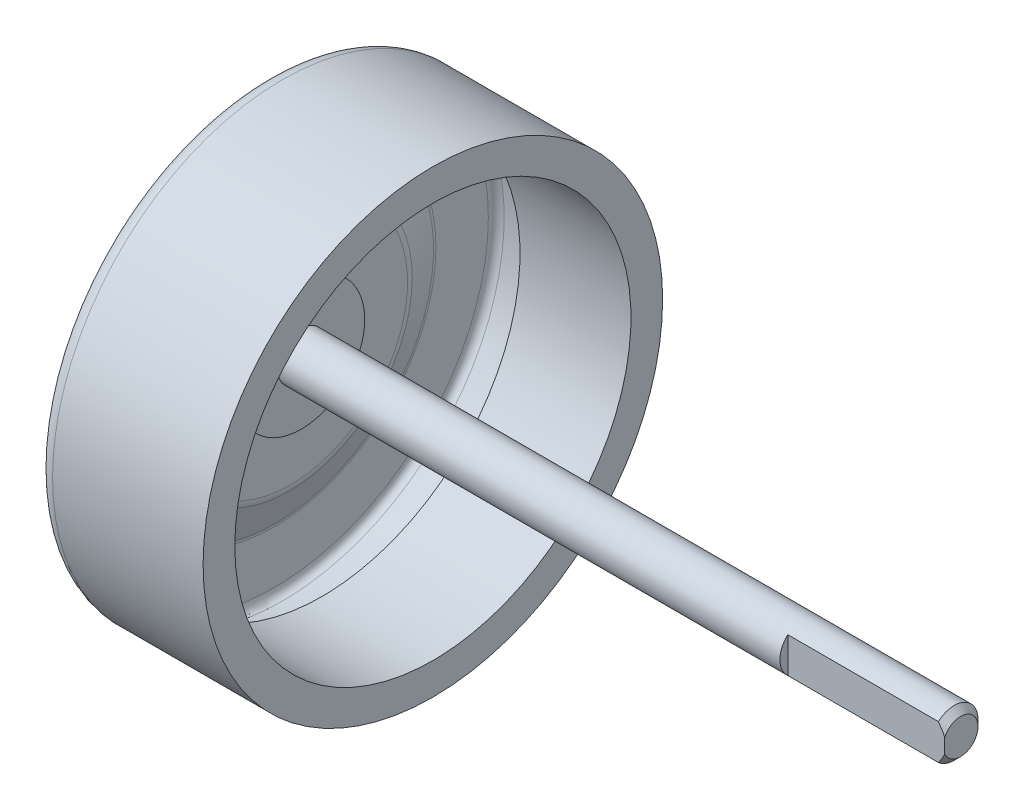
ISO-10303-21;
HEADER;
FILE_DESCRIPTION(('STEP AP214'),'2;1');
FILE_NAME('part.step','',(''),(''),'','','');
FILE_SCHEMA(('AUTOMOTIVE_DESIGN { 1 0 10303 214 1 1 1 1 }'));
ENDSEC;
DATA;
#1=APPLICATION_CONTEXT('core data for automotive mechanical design processes');
#2=APPLICATION_PROTOCOL_DEFINITION('international standard','automotive_design',2000,#1);
#3=PRODUCT_CONTEXT('',#1,'mechanical');
#4=PRODUCT('Part','Part','',(#3));
#5=PRODUCT_RELATED_PRODUCT_CATEGORY('part','',(#4));
#6=PRODUCT_DEFINITION_FORMATION('','',#4);
#7=PRODUCT_DEFINITION_CONTEXT('part definition',#1,'design');
#8=PRODUCT_DEFINITION('design','',#6,#7);
#9=PRODUCT_DEFINITION_SHAPE('','',#8);
#10=(LENGTH_UNIT() NAMED_UNIT(*) SI_UNIT(.MILLI.,.METRE.));
#11=(NAMED_UNIT(*) PLANE_ANGLE_UNIT() SI_UNIT($,.RADIAN.));
#12=(NAMED_UNIT(*) SI_UNIT($,.STERADIAN.) SOLID_ANGLE_UNIT());
#13=UNCERTAINTY_MEASURE_WITH_UNIT(LENGTH_MEASURE(1.E-05),#10,'distance_accuracy_value','');
#14=(GEOMETRIC_REPRESENTATION_CONTEXT(3) GLOBAL_UNCERTAINTY_ASSIGNED_CONTEXT((#13)) GLOBAL_UNIT_ASSIGNED_CONTEXT((#10,
#11,#12)) REPRESENTATION_CONTEXT('',''));
#15=CARTESIAN_POINT('',(0.,0.,0.));
#16=DIRECTION('',(0.,0.,1.));
#17=DIRECTION('',(1.,0.,0.));
#18=AXIS2_PLACEMENT_3D('',#15,#16,#17);
#19=CARTESIAN_POINT('',(43.8,1.5,0.));
#20=DIRECTION('',(-1.,0.,0.));
#21=DIRECTION('',(0.,0.,1.));
#22=AXIS2_PLACEMENT_3D('',#19,#20,#21);
#23=PLANE('',#22);
#24=DIRECTION('',(0.,1.,0.));
#25=VECTOR('',#24,1.);
#26=CARTESIAN_POINT('',(43.8,1.5,1.));
#27=LINE('',#26,#25);
#28=CARTESIAN_POINT('',(43.8000000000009,-0.458257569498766,1.));
#29=VERTEX_POINT('',#28);
#30=CARTESIAN_POINT('',(43.8,0.458257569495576,1.));
#31=VERTEX_POINT('',#30);
#32=EDGE_CURVE('E74',#29,#31,#27,.T.);
#33=ORIENTED_EDGE('',*,*,#32,.F.);
#34=CARTESIAN_POINT('',(43.8,0.,0.));
#35=DIRECTION('',(-1.,0.,0.));
#36=DIRECTION('',(0.,0.,1.));
#37=AXIS2_PLACEMENT_3D('',#34,#35,#36);
#38=CIRCLE('',#37,1.1);
#39=EDGE_CURVE('E145',#29,#31,#38,.F.);
#40=ORIENTED_EDGE('',*,*,#39,.T.);
#41=EDGE_LOOP('',(#33,#40));
#42=FACE_BOUND('',#41,.T.);
#43=ADVANCED_FACE('F33',(#42),#23,.F.);
#44=CARTESIAN_POINT('',(-6.43572750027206,0.,0.));
#45=DIRECTION('',(-1.,0.,0.));
#46=DIRECTION('',(0.,0.,1.));
#47=AXIS2_PLACEMENT_3D('',#44,#45,#46);
#48=CYLINDRICAL_SURFACE('',#47,1.5);
#49=CARTESIAN_POINT('',(2.2,0.,0.));
#50=DIRECTION('',(-1.,0.,0.));
#51=DIRECTION('',(0.,0.,1.));
#52=AXIS2_PLACEMENT_3D('',#49,#50,#51);
#53=CIRCLE('',#52,1.5);
#54=CARTESIAN_POINT('',(2.2,0.,1.5));
#55=VERTEX_POINT('',#54);
#56=EDGE_CURVE('E113',#55,#55,#53,.T.);
#57=ORIENTED_EDGE('',*,*,#56,.F.);
#58=EDGE_LOOP('',(#57));
#59=FACE_BOUND('',#58,.T.);
#60=CARTESIAN_POINT('',(33.9,0.,0.));
#61=DIRECTION('',(-1.,0.,0.));
#62=DIRECTION('',(0.,0.,1.));
#63=AXIS2_PLACEMENT_3D('',#60,#61,#62);
#64=CIRCLE('',#63,1.5);
#65=CARTESIAN_POINT('',(33.9,-1.11803398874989,1.));
#66=VERTEX_POINT('',#65);
#67=CARTESIAN_POINT('',(33.9,1.11803398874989,1.));
#68=VERTEX_POINT('',#67);
#69=EDGE_CURVE('E11',#66,#68,#64,.T.);
#70=ORIENTED_EDGE('',*,*,#69,.T.);
#71=DIRECTION('',(-1.,0.,0.));
#72=VECTOR('',#71,1.);
#73=CARTESIAN_POINT('',(-6.43572750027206,1.11803398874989,1.));
#74=LINE('',#73,#72);
#75=CARTESIAN_POINT('',(43.4,1.11803398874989,1.));
#76=VERTEX_POINT('',#75);
#77=EDGE_CURVE('E67',#76,#68,#74,.T.);
#78=ORIENTED_EDGE('',*,*,#77,.F.);
#79=CARTESIAN_POINT('',(43.4,0.,0.));
#80=DIRECTION('',(-1.,0.,0.));
#81=DIRECTION('',(0.,0.,1.));
#82=AXIS2_PLACEMENT_3D('',#79,#80,#81);
#83=CIRCLE('',#82,1.5);
#84=CARTESIAN_POINT('',(43.4,-1.11803398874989,1.));
#85=VERTEX_POINT('',#84);
#86=EDGE_CURVE('E143',#76,#85,#83,.T.);
#87=ORIENTED_EDGE('',*,*,#86,.T.);
#88=DIRECTION('',(-1.,0.,0.));
#89=VECTOR('',#88,1.);
#90=CARTESIAN_POINT('',(-6.43572750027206,-1.11803398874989,1.));
#91=LINE('',#90,#89);
#92=EDGE_CURVE('E48',#66,#85,#91,.F.);
#93=ORIENTED_EDGE('',*,*,#92,.F.);
#94=EDGE_LOOP('',(#70,#78,#87,#93));
#95=FACE_BOUND('',#94,.T.);
#96=ADVANCED_FACE('F65',(#59,#95),#48,.T.);
#97=CARTESIAN_POINT('',(43.4,0.,0.));
#98=DIRECTION('',(-1.,0.,0.));
#99=DIRECTION('',(0.,0.,1.));
#100=AXIS2_PLACEMENT_3D('',#97,#98,#99);
#101=CONICAL_SURFACE('',#100,1.5,0.785398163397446);
#102=ORIENTED_EDGE('',*,*,#86,.F.);
#103=CARTESIAN_POINT('',(41.5838704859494,3.16175820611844,1.));
#104=CARTESIAN_POINT('',(41.6907326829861,3.04963731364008,1.));
#105=CARTESIAN_POINT('',(41.7973646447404,2.93729302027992,1.));
#106=CARTESIAN_POINT('',(42.009902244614,2.7118529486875,1.));
#107=CARTESIAN_POINT('',(42.1158076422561,2.59875694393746,1.));
#108=CARTESIAN_POINT('',(42.3275807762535,2.37047715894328,1.));
#109=CARTESIAN_POINT('',(42.4334381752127,2.25528376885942,1.));
#110=CARTESIAN_POINT('',(42.6434934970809,2.02342800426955,1.));
#111=CARTESIAN_POINT('',(42.7476917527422,1.90676593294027,1.));
#112=CARTESIAN_POINT('',(42.9192876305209,1.71017138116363,1.));
#113=CARTESIAN_POINT('',(42.9874286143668,1.63089017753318,1.));
#114=CARTESIAN_POINT('',(43.1219727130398,1.47080590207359,1.));
#115=CARTESIAN_POINT('',(43.1883751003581,1.39000221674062,1.));
#116=CARTESIAN_POINT('',(43.3183508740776,1.22641779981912,1.));
#117=CARTESIAN_POINT('',(43.3819303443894,1.1436419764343,1.));
#118=CARTESIAN_POINT('',(43.4739505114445,1.01707595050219,1.));
#119=CARTESIAN_POINT('',(43.5040562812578,0.974501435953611,1.));
#120=CARTESIAN_POINT('',(43.5627796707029,0.888342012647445,1.));
#121=CARTESIAN_POINT('',(43.5913974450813,0.8447572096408,1.));
#122=CARTESIAN_POINT('',(43.6618365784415,0.732073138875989,1.));
#123=CARTESIAN_POINT('',(43.7022855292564,0.662097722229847,1.));
#124=CARTESIAN_POINT('',(43.7754550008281,0.518109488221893,1.));
#125=CARTESIAN_POINT('',(43.8081831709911,0.444100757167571,1.));
#126=CARTESIAN_POINT('',(43.8546882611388,0.309300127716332,1.));
#127=CARTESIAN_POINT('',(43.871105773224,0.249456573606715,1.));
#128=CARTESIAN_POINT('',(43.8935920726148,0.127975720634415,1.));
#129=CARTESIAN_POINT('',(43.8997011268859,0.06634636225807,1.));
#130=CARTESIAN_POINT('',(43.9002779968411,-0.057206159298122,1.));
#131=CARTESIAN_POINT('',(43.8947012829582,-0.119129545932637,1.));
#132=CARTESIAN_POINT('',(43.8730932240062,-0.241230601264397,1.));
#133=CARTESIAN_POINT('',(43.8570244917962,-0.301401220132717,1.));
#134=CARTESIAN_POINT('',(43.8157454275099,-0.423254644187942,1.));
#135=CARTESIAN_POINT('',(43.7899596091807,-0.48473378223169,1.));
#136=CARTESIAN_POINT('',(43.7324715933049,-0.604908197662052,1.));
#137=CARTESIAN_POINT('',(43.7007581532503,-0.663597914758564,1.));
#138=CARTESIAN_POINT('',(43.632966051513,-0.779494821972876,1.));
#139=CARTESIAN_POINT('',(43.5968311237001,-0.836668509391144,1.));
#140=CARTESIAN_POINT('',(43.5219076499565,-0.94915392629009,1.));
#141=CARTESIAN_POINT('',(43.4831214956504,-1.00446726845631,1.));
#142=CARTESIAN_POINT('',(43.4072707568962,-1.10878362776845,1.));
#143=CARTESIAN_POINT('',(43.3703676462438,-1.15790497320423,1.));
#144=CARTESIAN_POINT('',(43.2954067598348,-1.25526101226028,1.));
#145=CARTESIAN_POINT('',(43.2573488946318,-1.30349563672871,1.));
#146=CARTESIAN_POINT('',(43.141854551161,-1.44718735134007,1.));
#147=CARTESIAN_POINT('',(43.0631214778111,-1.54159990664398,1.));
#148=CARTESIAN_POINT('',(42.9034112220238,-1.72879325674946,1.));
#149=CARTESIAN_POINT('',(42.8224301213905,-1.82157067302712,1.));
#150=CARTESIAN_POINT('',(42.6590879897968,-2.0058678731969,1.));
#151=CARTESIAN_POINT('',(42.5767272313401,-2.0973878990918,1.));
#152=CARTESIAN_POINT('',(42.4190362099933,-2.27075857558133,1.));
#153=CARTESIAN_POINT('',(42.3437945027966,-2.35269003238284,1.));
#154=CARTESIAN_POINT('',(42.192719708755,-2.51601437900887,1.));
#155=CARTESIAN_POINT('',(42.1168865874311,-2.59740723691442,1.));
#156=CARTESIAN_POINT('',(41.9650490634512,-2.75948177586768,1.));
#157=CARTESIAN_POINT('',(41.8890462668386,-2.84016496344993,1.));
#158=CARTESIAN_POINT('',(41.7366956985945,-3.00119295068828,1.));
#159=CARTESIAN_POINT('',(41.6603479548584,-3.08153777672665,1.));
#160=CARTESIAN_POINT('',(41.5838704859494,-3.16175820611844,1.));
#161=B_SPLINE_CURVE_WITH_KNOTS('',3,(#103,#104,#105,#106,#107,#108,#109,#110,#111,#112,#113,
#114,#115,#116,#117,#118,#119,#120,#121,#122,#123,#124,#125,#126,#127,#128,#129,#130,#131,#132,
#133,#134,#135,#136,#137,#138,#139,#140,#141,#142,#143,#144,#145,#146,#147,#148,#149,#150,#151,
#152,#153,#154,#155,#156,#157,#158,#159,#160),.UNSPECIFIED.,.F.,.F.,(4,2,2,2,2,2,2,2,2,2,2,2,2,
2,2,2,2,2,2,2,2,2,2,2,2,2,2,2,4),(0.,0.464671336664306,0.929489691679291,1.39881843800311,
1.86805184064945,2.18165494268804,2.49538723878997,2.8084068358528,2.96481274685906,
3.12120235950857,3.36341337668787,3.60538340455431,3.79086077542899,3.975611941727,
4.16106839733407,4.34718933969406,4.54672711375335,4.74664724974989,4.94944525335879,
5.15206267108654,5.33635822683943,5.52066809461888,5.8894089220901,6.25883873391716,
6.628196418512,6.96190964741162,7.29564247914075,7.62817078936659,7.96067267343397),.UNSPECIFIED.);
#162=EDGE_CURVE('E41',#76,#31,#161,.T.);
#163=ORIENTED_EDGE('',*,*,#162,.T.);
#164=ORIENTED_EDGE('',*,*,#39,.F.);
#165=EDGE_CURVE('E147',#29,#85,#161,.T.);
#166=ORIENTED_EDGE('',*,*,#165,.T.);
#167=EDGE_LOOP('',(#102,#163,#164,#166));
#168=FACE_BOUND('',#167,.T.);
#169=ADVANCED_FACE('F153',(#168),#101,.T.);
#170=CARTESIAN_POINT('',(10.5000000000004,12.5,0.));
#171=DIRECTION('',(-1.,0.,0.));
#172=DIRECTION('',(0.,0.,1.));
#173=AXIS2_PLACEMENT_3D('',#170,#171,#172);
#174=PLANE('',#173);
#175=CARTESIAN_POINT('',(10.5000000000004,0.,0.));
#176=DIRECTION('',(-1.,0.,0.));
#177=DIRECTION('',(0.,0.,1.));
#178=AXIS2_PLACEMENT_3D('',#175,#176,#177);
#179=CIRCLE('',#178,14.5);
#180=CARTESIAN_POINT('',(10.5000000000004,0.,14.5));
#181=VERTEX_POINT('',#180);
#182=EDGE_CURVE('E140',#181,#181,#179,.T.);
#183=ORIENTED_EDGE('',*,*,#182,.F.);
#184=EDGE_LOOP('',(#183));
#185=FACE_BOUND('',#184,.T.);
#186=CARTESIAN_POINT('',(10.5000000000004,0.,0.));
#187=DIRECTION('',(-1.,0.,0.));
#188=DIRECTION('',(0.,0.,1.));
#189=AXIS2_PLACEMENT_3D('',#186,#187,#188);
#190=CIRCLE('',#189,12.5);
#191=CARTESIAN_POINT('',(10.5000000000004,0.,12.5));
#192=VERTEX_POINT('',#191);
#193=EDGE_CURVE('E73',#192,#192,#190,.T.);
#194=ORIENTED_EDGE('',*,*,#193,.T.);
#195=EDGE_LOOP('',(#194));
#196=FACE_BOUND('',#195,.T.);
#197=ADVANCED_FACE('F35',(#185,#196),#174,.F.);
#198=CARTESIAN_POINT('',(-6.43572750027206,0.,0.));
#199=DIRECTION('',(-1.,0.,0.));
#200=DIRECTION('',(0.,0.,1.));
#201=AXIS2_PLACEMENT_3D('',#198,#199,#200);
#202=CYLINDRICAL_SURFACE('',#201,14.5);
#203=CARTESIAN_POINT('',(1.00000000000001,0.,0.));
#204=DIRECTION('',(-1.,0.,0.));
#205=DIRECTION('',(0.,0.,1.));
#206=AXIS2_PLACEMENT_3D('',#203,#204,#205);
#207=CIRCLE('',#206,14.5);
#208=CARTESIAN_POINT('',(1.00000000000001,0.,14.5));
#209=VERTEX_POINT('',#208);
#210=EDGE_CURVE('E137',#209,#209,#207,.T.);
#211=ORIENTED_EDGE('',*,*,#210,.F.);
#212=EDGE_LOOP('',(#211));
#213=FACE_BOUND('',#212,.T.);
#214=ORIENTED_EDGE('',*,*,#182,.T.);
#215=EDGE_LOOP('',(#214));
#216=FACE_BOUND('',#215,.T.);
#217=ADVANCED_FACE('F208',(#213,#216),#202,.T.);
#218=CARTESIAN_POINT('',(1.,0.,0.));
#219=DIRECTION('',(-1.,0.,0.));
#220=DIRECTION('',(0.,0.,1.));
#221=AXIS2_PLACEMENT_3D('',#218,#219,#220);
#222=TOROIDAL_SURFACE('',#221,13.5,1.);
#223=CARTESIAN_POINT('',(0.,0.,0.));
#224=DIRECTION('',(-1.,0.,0.));
#225=DIRECTION('',(0.,0.,1.));
#226=AXIS2_PLACEMENT_3D('',#223,#224,#225);
#227=CIRCLE('',#226,13.5);
#228=CARTESIAN_POINT('',(0.,0.,13.5));
#229=VERTEX_POINT('',#228);
#230=EDGE_CURVE('E134',#229,#229,#227,.T.);
#231=ORIENTED_EDGE('',*,*,#230,.F.);
#232=EDGE_LOOP('',(#231));
#233=FACE_BOUND('',#232,.T.);
#234=ORIENTED_EDGE('',*,*,#210,.T.);
#235=EDGE_LOOP('',(#234));
#236=FACE_BOUND('',#235,.T.);
#237=ADVANCED_FACE('F205',(#233,#236),#222,.T.);
#238=CARTESIAN_POINT('',(0.,13.5,0.));
#239=DIRECTION('',(1.,0.,0.));
#240=DIRECTION('',(0.,0.,-1.));
#241=AXIS2_PLACEMENT_3D('',#238,#239,#240);
#242=PLANE('',#241);
#243=CARTESIAN_POINT('',(0.,0.,0.));
#244=DIRECTION('',(-1.,0.,0.));
#245=DIRECTION('',(0.,0.,1.));
#246=AXIS2_PLACEMENT_3D('',#243,#244,#245);
#247=CIRCLE('',#246,10.1925824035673);
#248=CARTESIAN_POINT('',(0.,0.,10.1925824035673));
#249=VERTEX_POINT('',#248);
#250=EDGE_CURVE('E131',#249,#249,#247,.T.);
#251=ORIENTED_EDGE('',*,*,#250,.F.);
#252=EDGE_LOOP('',(#251));
#253=FACE_BOUND('',#252,.T.);
#254=ORIENTED_EDGE('',*,*,#230,.T.);
#255=EDGE_LOOP('',(#254));
#256=FACE_BOUND('',#255,.T.);
#257=ADVANCED_FACE('F201',(#253,#256),#242,.F.);
#258=CARTESIAN_POINT('',(1.,0.,0.));
#259=DIRECTION('',(-1.,0.,0.));
#260=DIRECTION('',(0.,0.,1.));
#261=AXIS2_PLACEMENT_3D('',#258,#259,#260);
#262=TOROIDAL_SURFACE('',#261,10.1925824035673,1.);
#263=CARTESIAN_POINT('',(0.071523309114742,0.,0.));
#264=DIRECTION('',(-1.,0.,0.));
#265=DIRECTION('',(0.,0.,1.));
#266=AXIS2_PLACEMENT_3D('',#263,#264,#265);
#267=CIRCLE('',#266,9.82119172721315);
#268=CARTESIAN_POINT('',(0.071523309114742,0.,9.82119172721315));
#269=VERTEX_POINT('',#268);
#270=EDGE_CURVE('E128',#269,#269,#267,.T.);
#271=ORIENTED_EDGE('',*,*,#270,.F.);
#272=EDGE_LOOP('',(#271));
#273=FACE_BOUND('',#272,.T.);
#274=ORIENTED_EDGE('',*,*,#250,.T.);
#275=EDGE_LOOP('',(#274));
#276=FACE_BOUND('',#275,.T.);
#277=ADVANCED_FACE('F197',(#273,#276),#262,.T.);
#278=CARTESIAN_POINT('',(0.071523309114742,0.,0.));
#279=DIRECTION('',(-1.,0.,0.));
#280=DIRECTION('',(0.,0.,1.));
#281=AXIS2_PLACEMENT_3D('',#278,#279,#280);
#282=CONICAL_SURFACE('',#281,9.82119172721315,1.19028994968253);
#283=CARTESIAN_POINT('',(0.964238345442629,0.,0.));
#284=DIRECTION('',(-1.,0.,0.));
#285=DIRECTION('',(0.,0.,1.));
#286=AXIS2_PLACEMENT_3D('',#283,#284,#285);
#287=CIRCLE('',#286,7.58940413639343);
#288=CARTESIAN_POINT('',(0.964238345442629,0.,7.58940413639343));
#289=VERTEX_POINT('',#288);
#290=EDGE_CURVE('E125',#289,#289,#287,.T.);
#291=ORIENTED_EDGE('',*,*,#290,.F.);
#292=EDGE_LOOP('',(#291));
#293=FACE_BOUND('',#292,.T.);
#294=ORIENTED_EDGE('',*,*,#270,.T.);
#295=EDGE_LOOP('',(#294));
#296=FACE_BOUND('',#295,.T.);
#297=ADVANCED_FACE('F193',(#293,#296),#282,.F.);
#298=CARTESIAN_POINT('',(0.5,0.,0.));
#299=DIRECTION('',(-1.,0.,0.));
#300=DIRECTION('',(0.,0.,1.));
#301=AXIS2_PLACEMENT_3D('',#298,#299,#300);
#302=TOROIDAL_SURFACE('',#301,7.40370879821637,0.5);
#303=CARTESIAN_POINT('',(1.,0.,0.));
#304=DIRECTION('',(-1.,0.,0.));
#305=DIRECTION('',(0.,0.,1.));
#306=AXIS2_PLACEMENT_3D('',#303,#304,#305);
#307=CIRCLE('',#306,7.40370879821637);
#308=CARTESIAN_POINT('',(1.,0.,7.40370879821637));
#309=VERTEX_POINT('',#308);
#310=EDGE_CURVE('E122',#309,#309,#307,.T.);
#311=ORIENTED_EDGE('',*,*,#310,.F.);
#312=EDGE_LOOP('',(#311));
#313=FACE_BOUND('',#312,.T.);
#314=ORIENTED_EDGE('',*,*,#290,.T.);
#315=EDGE_LOOP('',(#314));
#316=FACE_BOUND('',#315,.T.);
#317=ADVANCED_FACE('F189',(#313,#316),#302,.F.);
#318=CARTESIAN_POINT('',(1.,4.,0.));
#319=DIRECTION('',(1.,0.,0.));
#320=DIRECTION('',(0.,0.,-1.));
#321=AXIS2_PLACEMENT_3D('',#318,#319,#320);
#322=PLANE('',#321);
#323=CARTESIAN_POINT('',(1.,0.,0.));
#324=DIRECTION('',(-1.,0.,0.));
#325=DIRECTION('',(0.,0.,1.));
#326=AXIS2_PLACEMENT_3D('',#323,#324,#325);
#327=CIRCLE('',#326,4.);
#328=CARTESIAN_POINT('',(1.,0.,4.));
#329=VERTEX_POINT('',#328);
#330=EDGE_CURVE('E119',#329,#329,#327,.T.);
#331=ORIENTED_EDGE('',*,*,#330,.F.);
#332=EDGE_LOOP('',(#331));
#333=FACE_BOUND('',#332,.T.);
#334=ORIENTED_EDGE('',*,*,#310,.T.);
#335=EDGE_LOOP('',(#334));
#336=FACE_BOUND('',#335,.T.);
#337=ADVANCED_FACE('F185',(#333,#336),#322,.F.);
#338=CARTESIAN_POINT('',(-6.43572750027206,0.,0.));
#339=DIRECTION('',(-1.,0.,0.));
#340=DIRECTION('',(0.,0.,1.));
#341=AXIS2_PLACEMENT_3D('',#338,#339,#340);
#342=CYLINDRICAL_SURFACE('',#341,4.);
#343=CARTESIAN_POINT('',(0.8,0.,0.));
#344=DIRECTION('',(-1.,0.,0.));
#345=DIRECTION('',(0.,0.,1.));
#346=AXIS2_PLACEMENT_3D('',#343,#344,#345);
#347=CIRCLE('',#346,4.);
#348=CARTESIAN_POINT('',(0.8,0.,4.));
#349=VERTEX_POINT('',#348);
#350=EDGE_CURVE('E116',#349,#349,#347,.T.);
#351=ORIENTED_EDGE('',*,*,#350,.F.);
#352=EDGE_LOOP('',(#351));
#353=FACE_BOUND('',#352,.T.);
#354=ORIENTED_EDGE('',*,*,#330,.T.);
#355=EDGE_LOOP('',(#354));
#356=FACE_BOUND('',#355,.T.);
#357=ADVANCED_FACE('F181',(#353,#356),#342,.T.);
#358=CARTESIAN_POINT('',(0.8,0.,0.));
#359=DIRECTION('',(1.,0.,0.));
#360=DIRECTION('',(0.,0.,-1.));
#361=AXIS2_PLACEMENT_3D('',#358,#359,#360);
#362=PLANE('',#361);
#363=ORIENTED_EDGE('',*,*,#350,.T.);
#364=EDGE_LOOP('',(#363));
#365=FACE_BOUND('',#364,.T.);
#366=ADVANCED_FACE('F177',(#365),#362,.F.);
#367=CARTESIAN_POINT('',(2.2,4.,0.));
#368=DIRECTION('',(-1.,0.,0.));
#369=DIRECTION('',(0.,0.,1.));
#370=AXIS2_PLACEMENT_3D('',#367,#368,#369);
#371=PLANE('',#370);
#372=CARTESIAN_POINT('',(2.2,0.,0.));
#373=DIRECTION('',(-1.,0.,0.));
#374=DIRECTION('',(0.,0.,1.));
#375=AXIS2_PLACEMENT_3D('',#372,#373,#374);
#376=CIRCLE('',#375,4.);
#377=CARTESIAN_POINT('',(2.2,0.,4.));
#378=VERTEX_POINT('',#377);
#379=EDGE_CURVE('E110',#378,#378,#376,.T.);
#380=ORIENTED_EDGE('',*,*,#379,.F.);
#381=EDGE_LOOP('',(#380));
#382=FACE_BOUND('',#381,.T.);
#383=ORIENTED_EDGE('',*,*,#56,.T.);
#384=EDGE_LOOP('',(#383));
#385=FACE_BOUND('',#384,.T.);
#386=ADVANCED_FACE('F180',(#382,#385),#371,.F.);
#387=CARTESIAN_POINT('',(-6.43572750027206,0.,0.));
#388=DIRECTION('',(-1.,0.,0.));
#389=DIRECTION('',(0.,0.,1.));
#390=AXIS2_PLACEMENT_3D('',#387,#388,#389);
#391=CYLINDRICAL_SURFACE('',#390,4.);
#392=CARTESIAN_POINT('',(1.5,0.,0.));
#393=DIRECTION('',(-1.,0.,0.));
#394=DIRECTION('',(0.,0.,1.));
#395=AXIS2_PLACEMENT_3D('',#392,#393,#394);
#396=CIRCLE('',#395,4.);
#397=CARTESIAN_POINT('',(1.5,0.,4.));
#398=VERTEX_POINT('',#397);
#399=EDGE_CURVE('E107',#398,#398,#396,.T.);
#400=ORIENTED_EDGE('',*,*,#399,.F.);
#401=EDGE_LOOP('',(#400));
#402=FACE_BOUND('',#401,.T.);
#403=ORIENTED_EDGE('',*,*,#379,.T.);
#404=EDGE_LOOP('',(#403));
#405=FACE_BOUND('',#404,.T.);
#406=ADVANCED_FACE('F268',(#402,#405),#391,.T.);
#407=CARTESIAN_POINT('',(1.5,4.,0.));
#408=DIRECTION('',(-1.,0.,0.));
#409=DIRECTION('',(0.,0.,1.));
#410=AXIS2_PLACEMENT_3D('',#407,#408,#409);
#411=PLANE('',#410);
#412=CARTESIAN_POINT('',(1.5,0.,0.));
#413=DIRECTION('',(-1.,0.,0.));
#414=DIRECTION('',(0.,0.,1.));
#415=AXIS2_PLACEMENT_3D('',#412,#413,#414);
#416=CIRCLE('',#415,7.40370879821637);
#417=CARTESIAN_POINT('',(1.5,0.,7.40370879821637));
#418=VERTEX_POINT('',#417);
#419=EDGE_CURVE('E104',#418,#418,#416,.T.);
#420=ORIENTED_EDGE('',*,*,#419,.F.);
#421=EDGE_LOOP('',(#420));
#422=FACE_BOUND('',#421,.T.);
#423=ORIENTED_EDGE('',*,*,#399,.T.);
#424=EDGE_LOOP('',(#423));
#425=FACE_BOUND('',#424,.T.);
#426=ADVANCED_FACE('F262',(#422,#425),#411,.F.);
#427=CARTESIAN_POINT('',(0.5,0.,0.));
#428=DIRECTION('',(-1.,0.,0.));
#429=DIRECTION('',(0.,0.,1.));
#430=AXIS2_PLACEMENT_3D('',#427,#428,#429);
#431=TOROIDAL_SURFACE('',#430,7.40370879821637,1.);
#432=CARTESIAN_POINT('',(1.42847669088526,0.,0.));
#433=DIRECTION('',(-1.,0.,0.));
#434=DIRECTION('',(0.,0.,1.));
#435=AXIS2_PLACEMENT_3D('',#432,#433,#434);
#436=CIRCLE('',#435,7.77509947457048);
#437=CARTESIAN_POINT('',(1.42847669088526,0.,7.77509947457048));
#438=VERTEX_POINT('',#437);
#439=EDGE_CURVE('E101',#438,#438,#436,.T.);
#440=ORIENTED_EDGE('',*,*,#439,.F.);
#441=EDGE_LOOP('',(#440));
#442=FACE_BOUND('',#441,.T.);
#443=ORIENTED_EDGE('',*,*,#419,.T.);
#444=EDGE_LOOP('',(#443));
#445=FACE_BOUND('',#444,.T.);
#446=ADVANCED_FACE('F256',(#442,#445),#431,.T.);
#447=CARTESIAN_POINT('',(1.42847669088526,0.,0.));
#448=DIRECTION('',(-1.,0.,0.));
#449=DIRECTION('',(0.,0.,1.));
#450=AXIS2_PLACEMENT_3D('',#447,#448,#449);
#451=CONICAL_SURFACE('',#450,7.77509947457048,1.19028994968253);
#452=CARTESIAN_POINT('',(0.535761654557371,0.,0.));
#453=DIRECTION('',(-1.,0.,0.));
#454=DIRECTION('',(0.,0.,1.));
#455=AXIS2_PLACEMENT_3D('',#452,#453,#454);
#456=CIRCLE('',#455,10.0068870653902);
#457=CARTESIAN_POINT('',(0.535761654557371,0.,10.0068870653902));
#458=VERTEX_POINT('',#457);
#459=EDGE_CURVE('E98',#458,#458,#456,.T.);
#460=ORIENTED_EDGE('',*,*,#459,.F.);
#461=EDGE_LOOP('',(#460));
#462=FACE_BOUND('',#461,.T.);
#463=ORIENTED_EDGE('',*,*,#439,.T.);
#464=EDGE_LOOP('',(#463));
#465=FACE_BOUND('',#464,.T.);
#466=ADVANCED_FACE('F250',(#462,#465),#451,.T.);
#467=CARTESIAN_POINT('',(1.,0.,0.));
#468=DIRECTION('',(-1.,0.,0.));
#469=DIRECTION('',(0.,0.,1.));
#470=AXIS2_PLACEMENT_3D('',#467,#468,#469);
#471=TOROIDAL_SURFACE('',#470,10.1925824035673,0.5);
#472=CARTESIAN_POINT('',(0.5,0.,0.));
#473=DIRECTION('',(-1.,0.,0.));
#474=DIRECTION('',(0.,0.,1.));
#475=AXIS2_PLACEMENT_3D('',#472,#473,#474);
#476=CIRCLE('',#475,10.1925824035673);
#477=CARTESIAN_POINT('',(0.5,0.,10.1925824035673));
#478=VERTEX_POINT('',#477);
#479=EDGE_CURVE('E95',#478,#478,#476,.T.);
#480=ORIENTED_EDGE('',*,*,#479,.F.);
#481=EDGE_LOOP('',(#480));
#482=FACE_BOUND('',#481,.T.);
#483=ORIENTED_EDGE('',*,*,#459,.T.);
#484=EDGE_LOOP('',(#483));
#485=FACE_BOUND('',#484,.T.);
#486=ADVANCED_FACE('F244',(#482,#485),#471,.F.);
#487=CARTESIAN_POINT('',(0.5,13.5,0.));
#488=DIRECTION('',(-1.,0.,0.));
#489=DIRECTION('',(0.,0.,1.));
#490=AXIS2_PLACEMENT_3D('',#487,#488,#489);
#491=PLANE('',#490);
#492=CARTESIAN_POINT('',(0.5,0.,0.));
#493=DIRECTION('',(-1.,0.,0.));
#494=DIRECTION('',(0.,0.,1.));
#495=AXIS2_PLACEMENT_3D('',#492,#493,#494);
#496=CIRCLE('',#495,13.5);
#497=CARTESIAN_POINT('',(0.5,0.,13.5));
#498=VERTEX_POINT('',#497);
#499=EDGE_CURVE('E92',#498,#498,#496,.T.);
#500=ORIENTED_EDGE('',*,*,#499,.F.);
#501=EDGE_LOOP('',(#500));
#502=FACE_BOUND('',#501,.T.);
#503=ORIENTED_EDGE('',*,*,#479,.T.);
#504=EDGE_LOOP('',(#503));
#505=FACE_BOUND('',#504,.T.);
#506=ADVANCED_FACE('F238',(#502,#505),#491,.F.);
#507=CARTESIAN_POINT('',(1.,0.,0.));
#508=DIRECTION('',(-1.,0.,0.));
#509=DIRECTION('',(0.,0.,1.));
#510=AXIS2_PLACEMENT_3D('',#507,#508,#509);
#511=TOROIDAL_SURFACE('',#510,13.5,0.5);
#512=CARTESIAN_POINT('',(1.,0.,0.));
#513=DIRECTION('',(-1.,0.,0.));
#514=DIRECTION('',(0.,0.,1.));
#515=AXIS2_PLACEMENT_3D('',#512,#513,#514);
#516=CIRCLE('',#515,14.);
#517=CARTESIAN_POINT('',(1.,0.,14.));
#518=VERTEX_POINT('',#517);
#519=EDGE_CURVE('E89',#518,#518,#516,.T.);
#520=ORIENTED_EDGE('',*,*,#519,.F.);
#521=EDGE_LOOP('',(#520));
#522=FACE_BOUND('',#521,.T.);
#523=ORIENTED_EDGE('',*,*,#499,.T.);
#524=EDGE_LOOP('',(#523));
#525=FACE_BOUND('',#524,.T.);
#526=ADVANCED_FACE('F232',(#522,#525),#511,.F.);
#527=CARTESIAN_POINT('',(-6.43572750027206,0.,0.));
#528=DIRECTION('',(-1.,0.,0.));
#529=DIRECTION('',(0.,0.,1.));
#530=AXIS2_PLACEMENT_3D('',#527,#528,#529);
#531=CYLINDRICAL_SURFACE('',#530,14.);
#532=CARTESIAN_POINT('',(3.5,0.,0.));
#533=DIRECTION('',(-1.,0.,0.));
#534=DIRECTION('',(0.,0.,1.));
#535=AXIS2_PLACEMENT_3D('',#532,#533,#534);
#536=CIRCLE('',#535,14.);
#537=CARTESIAN_POINT('',(3.5,0.,14.));
#538=VERTEX_POINT('',#537);
#539=EDGE_CURVE('E86',#538,#538,#536,.T.);
#540=ORIENTED_EDGE('',*,*,#539,.F.);
#541=EDGE_LOOP('',(#540));
#542=FACE_BOUND('',#541,.T.);
#543=ORIENTED_EDGE('',*,*,#519,.T.);
#544=EDGE_LOOP('',(#543));
#545=FACE_BOUND('',#544,.T.);
#546=ADVANCED_FACE('F226',(#542,#545),#531,.F.);
#547=CARTESIAN_POINT('',(3.5,14.,0.));
#548=DIRECTION('',(1.,0.,0.));
#549=DIRECTION('',(0.,0.,-1.));
#550=AXIS2_PLACEMENT_3D('',#547,#548,#549);
#551=PLANE('',#550);
#552=CARTESIAN_POINT('',(3.5,0.,0.));
#553=DIRECTION('',(-1.,0.,0.));
#554=DIRECTION('',(0.,0.,1.));
#555=AXIS2_PLACEMENT_3D('',#552,#553,#554);
#556=CIRCLE('',#555,12.5);
#557=CARTESIAN_POINT('',(3.5,0.,12.5));
#558=VERTEX_POINT('',#557);
#559=EDGE_CURVE('E83',#558,#558,#556,.T.);
#560=ORIENTED_EDGE('',*,*,#559,.F.);
#561=EDGE_LOOP('',(#560));
#562=FACE_BOUND('',#561,.T.);
#563=ORIENTED_EDGE('',*,*,#539,.T.);
#564=EDGE_LOOP('',(#563));
#565=FACE_BOUND('',#564,.T.);
#566=ADVANCED_FACE('F164',(#562,#565),#551,.F.);
#567=CARTESIAN_POINT('',(-6.43572750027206,0.,0.));
#568=DIRECTION('',(-1.,0.,0.));
#569=DIRECTION('',(0.,0.,1.));
#570=AXIS2_PLACEMENT_3D('',#567,#568,#569);
#571=CYLINDRICAL_SURFACE('',#570,12.5);
#572=ORIENTED_EDGE('',*,*,#193,.F.);
#573=EDGE_LOOP('',(#572));
#574=FACE_BOUND('',#573,.T.);
#575=ORIENTED_EDGE('',*,*,#559,.T.);
#576=EDGE_LOOP('',(#575));
#577=FACE_BOUND('',#576,.T.);
#578=ADVANCED_FACE('F160',(#574,#577),#571,.F.);
#579=CARTESIAN_POINT('',(33.9,2.93739797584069,1.));
#580=DIRECTION('',(-1.,0.,0.));
#581=DIRECTION('',(0.,0.,1.));
#582=AXIS2_PLACEMENT_3D('',#579,#580,#581);
#583=PLANE('',#582);
#584=ORIENTED_EDGE('',*,*,#69,.F.);
#585=DIRECTION('',(0.,-1.,0.));
#586=VECTOR('',#585,1.);
#587=CARTESIAN_POINT('',(33.9,2.93739797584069,1.));
#588=LINE('',#587,#586);
#589=EDGE_CURVE('E72',#68,#66,#588,.T.);
#590=ORIENTED_EDGE('',*,*,#589,.F.);
#591=EDGE_LOOP('',(#584,#590));
#592=FACE_BOUND('',#591,.T.);
#593=ADVANCED_FACE('F76',(#592),#583,.F.);
#594=CARTESIAN_POINT('',(33.9,-2.73481880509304,1.));
#595=DIRECTION('',(0.,0.,1.));
#596=DIRECTION('',(1.,0.,0.));
#597=AXIS2_PLACEMENT_3D('',#594,#595,#596);
#598=PLANE('',#597);
#599=ORIENTED_EDGE('',*,*,#77,.T.);
#600=ORIENTED_EDGE('',*,*,#589,.T.);
#601=ORIENTED_EDGE('',*,*,#92,.T.);
#602=ORIENTED_EDGE('',*,*,#165,.F.);
#603=ORIENTED_EDGE('',*,*,#32,.T.);
#604=ORIENTED_EDGE('',*,*,#162,.F.);
#605=EDGE_LOOP('',(#599,#600,#601,#602,#603,#604));
#606=FACE_BOUND('',#605,.T.);
#607=ADVANCED_FACE('F71',(#606),#598,.T.);
#608=CLOSED_SHELL('',(#43,#96,#169,#197,#217,#237,#257,#277,#297,#317,#337,#357,#366,#386,#406,
#426,#446,#466,#486,#506,#526,#546,#566,#578,#593,#607));
#609=MANIFOLD_SOLID_BREP('B2',#608);
#610=ADVANCED_BREP_SHAPE_REPRESENTATION('',(#18,#609),#14);
#611=SHAPE_DEFINITION_REPRESENTATION(#9,#610);
ENDSEC;
END-ISO-10303-21;
